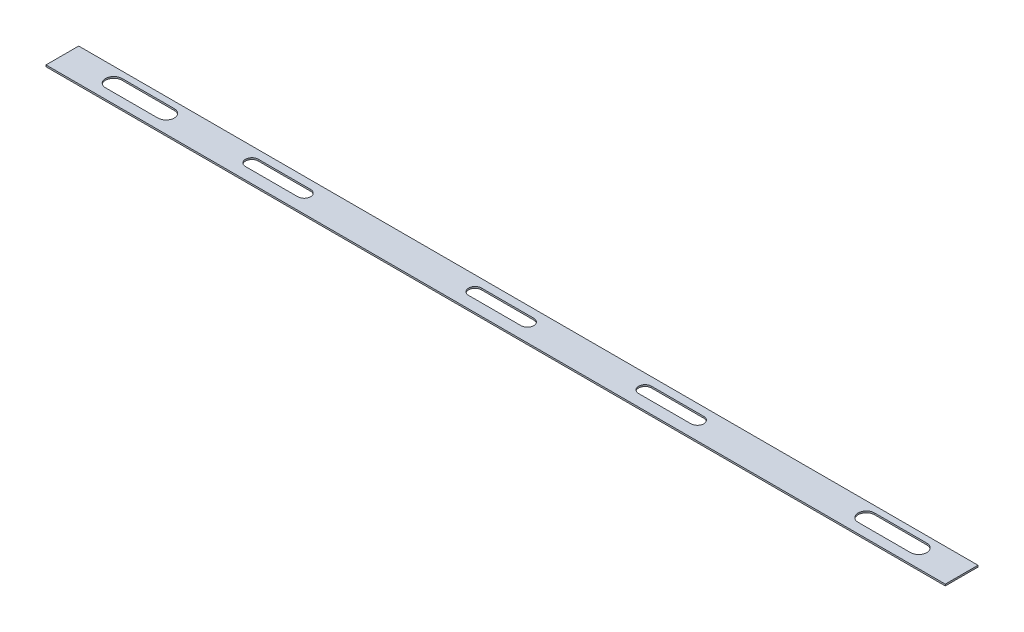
ISO-10303-21;
HEADER;
FILE_DESCRIPTION(('STEP AP214'),'2;1');
FILE_NAME('part.step','',(''),(''),'','','');
FILE_SCHEMA(('AUTOMOTIVE_DESIGN { 1 0 10303 214 1 1 1 1 }'));
ENDSEC;
DATA;
#1=APPLICATION_CONTEXT('core data for automotive mechanical design processes');
#2=APPLICATION_PROTOCOL_DEFINITION('international standard','automotive_design',2000,#1);
#3=PRODUCT_CONTEXT('',#1,'mechanical');
#4=PRODUCT('Part','Part','',(#3));
#5=PRODUCT_RELATED_PRODUCT_CATEGORY('part','',(#4));
#6=PRODUCT_DEFINITION_FORMATION('','',#4);
#7=PRODUCT_DEFINITION_CONTEXT('part definition',#1,'design');
#8=PRODUCT_DEFINITION('design','',#6,#7);
#9=PRODUCT_DEFINITION_SHAPE('','',#8);
#10=(LENGTH_UNIT() NAMED_UNIT(*) SI_UNIT(.MILLI.,.METRE.));
#11=(NAMED_UNIT(*) PLANE_ANGLE_UNIT() SI_UNIT($,.RADIAN.));
#12=(NAMED_UNIT(*) SI_UNIT($,.STERADIAN.) SOLID_ANGLE_UNIT());
#13=UNCERTAINTY_MEASURE_WITH_UNIT(LENGTH_MEASURE(1.E-05),#10,'distance_accuracy_value','');
#14=(GEOMETRIC_REPRESENTATION_CONTEXT(3) GLOBAL_UNCERTAINTY_ASSIGNED_CONTEXT((#13)) GLOBAL_UNIT_ASSIGNED_CONTEXT((#10,
#11,#12)) REPRESENTATION_CONTEXT('',''));
#15=CARTESIAN_POINT('',(0.,0.,0.));
#16=DIRECTION('',(0.,0.,1.));
#17=DIRECTION('',(1.,0.,0.));
#18=AXIS2_PLACEMENT_3D('',#15,#16,#17);
#19=CARTESIAN_POINT('',(0.,0.635,0.));
#20=DIRECTION('',(1.,0.,0.));
#21=DIRECTION('',(0.,0.,-1.));
#22=AXIS2_PLACEMENT_3D('',#19,#20,#21);
#23=PLANE('',#22);
#24=DIRECTION('',(0.,0.,1.));
#25=VECTOR('',#24,1.);
#26=CARTESIAN_POINT('',(0.,0.,0.));
#27=LINE('',#26,#25);
#28=CARTESIAN_POINT('',(0.,0.,-12.7));
#29=VERTEX_POINT('',#28);
#30=CARTESIAN_POINT('',(0.,0.,0.));
#31=VERTEX_POINT('',#30);
#32=EDGE_CURVE('E247',#29,#31,#27,.T.);
#33=ORIENTED_EDGE('',*,*,#32,.T.);
#34=DIRECTION('',(0.,-1.,0.));
#35=VECTOR('',#34,1.);
#36=CARTESIAN_POINT('',(0.,0.635,0.));
#37=LINE('',#36,#35);
#38=CARTESIAN_POINT('',(0.,0.635,0.));
#39=VERTEX_POINT('',#38);
#40=EDGE_CURVE('E11',#39,#31,#37,.T.);
#41=ORIENTED_EDGE('',*,*,#40,.F.);
#42=DIRECTION('',(0.,0.,1.));
#43=VECTOR('',#42,1.);
#44=CARTESIAN_POINT('',(0.,0.635,0.));
#45=LINE('',#44,#43);
#46=CARTESIAN_POINT('',(0.,0.635,-12.7));
#47=VERTEX_POINT('',#46);
#48=EDGE_CURVE('E426',#47,#39,#45,.T.);
#49=ORIENTED_EDGE('',*,*,#48,.F.);
#50=DIRECTION('',(0.,-1.,0.));
#51=VECTOR('',#50,1.);
#52=CARTESIAN_POINT('',(0.,0.635,-12.7));
#53=LINE('',#52,#51);
#54=EDGE_CURVE('E440',#47,#29,#53,.T.);
#55=ORIENTED_EDGE('',*,*,#54,.T.);
#56=EDGE_LOOP('',(#33,#41,#49,#55));
#57=FACE_BOUND('',#56,.T.);
#58=ADVANCED_FACE('F39',(#57),#23,.F.);
#59=CARTESIAN_POINT('',(0.,0.635,0.));
#60=DIRECTION('',(0.,0.,-1.));
#61=DIRECTION('',(-1.,0.,0.));
#62=AXIS2_PLACEMENT_3D('',#59,#60,#61);
#63=PLANE('',#62);
#64=DIRECTION('',(1.,0.,0.));
#65=VECTOR('',#64,1.);
#66=CARTESIAN_POINT('',(0.,0.,0.));
#67=LINE('',#66,#65);
#68=CARTESIAN_POINT('',(349.25,0.,0.));
#69=VERTEX_POINT('',#68);
#70=EDGE_CURVE('E444',#31,#69,#67,.T.);
#71=ORIENTED_EDGE('',*,*,#70,.T.);
#72=DIRECTION('',(0.,-1.,0.));
#73=VECTOR('',#72,1.);
#74=CARTESIAN_POINT('',(349.25,0.635,0.));
#75=LINE('',#74,#73);
#76=CARTESIAN_POINT('',(349.25,0.635,0.));
#77=VERTEX_POINT('',#76);
#78=EDGE_CURVE('E47',#77,#69,#75,.T.);
#79=ORIENTED_EDGE('',*,*,#78,.F.);
#80=DIRECTION('',(1.,0.,0.));
#81=VECTOR('',#80,1.);
#82=CARTESIAN_POINT('',(0.,0.635,0.));
#83=LINE('',#82,#81);
#84=EDGE_CURVE('E430',#39,#77,#83,.T.);
#85=ORIENTED_EDGE('',*,*,#84,.F.);
#86=ORIENTED_EDGE('',*,*,#40,.T.);
#87=EDGE_LOOP('',(#71,#79,#85,#86));
#88=FACE_BOUND('',#87,.T.);
#89=ADVANCED_FACE('F479',(#88),#63,.F.);
#90=CARTESIAN_POINT('',(349.25,0.635,0.));
#91=DIRECTION('',(-1.,0.,0.));
#92=DIRECTION('',(0.,0.,1.));
#93=AXIS2_PLACEMENT_3D('',#90,#91,#92);
#94=PLANE('',#93);
#95=DIRECTION('',(0.,0.,-1.));
#96=VECTOR('',#95,1.);
#97=CARTESIAN_POINT('',(349.25,0.,0.));
#98=LINE('',#97,#96);
#99=CARTESIAN_POINT('',(349.25,0.,-12.7));
#100=VERTEX_POINT('',#99);
#101=EDGE_CURVE('E447',#69,#100,#98,.T.);
#102=ORIENTED_EDGE('',*,*,#101,.T.);
#103=DIRECTION('',(0.,-1.,0.));
#104=VECTOR('',#103,1.);
#105=CARTESIAN_POINT('',(349.25,0.635,-12.7));
#106=LINE('',#105,#104);
#107=CARTESIAN_POINT('',(349.25,0.635,-12.7));
#108=VERTEX_POINT('',#107);
#109=EDGE_CURVE('E455',#108,#100,#106,.T.);
#110=ORIENTED_EDGE('',*,*,#109,.F.);
#111=DIRECTION('',(0.,0.,-1.));
#112=VECTOR('',#111,1.);
#113=CARTESIAN_POINT('',(349.25,0.635,0.));
#114=LINE('',#113,#112);
#115=EDGE_CURVE('E434',#77,#108,#114,.T.);
#116=ORIENTED_EDGE('',*,*,#115,.F.);
#117=ORIENTED_EDGE('',*,*,#78,.T.);
#118=EDGE_LOOP('',(#102,#110,#116,#117));
#119=FACE_BOUND('',#118,.T.);
#120=ADVANCED_FACE('F464',(#119),#94,.F.);
#121=CARTESIAN_POINT('',(0.,0.635,-12.7));
#122=DIRECTION('',(0.,0.,1.));
#123=DIRECTION('',(1.,0.,0.));
#124=AXIS2_PLACEMENT_3D('',#121,#122,#123);
#125=PLANE('',#124);
#126=DIRECTION('',(-1.,0.,0.));
#127=VECTOR('',#126,1.);
#128=CARTESIAN_POINT('',(0.,0.,-12.7));
#129=LINE('',#128,#127);
#130=EDGE_CURVE('E431',#100,#29,#129,.T.);
#131=ORIENTED_EDGE('',*,*,#130,.T.);
#132=ORIENTED_EDGE('',*,*,#54,.F.);
#133=DIRECTION('',(-1.,0.,0.));
#134=VECTOR('',#133,1.);
#135=CARTESIAN_POINT('',(0.,0.635,-12.7));
#136=LINE('',#135,#134);
#137=EDGE_CURVE('E437',#108,#47,#136,.T.);
#138=ORIENTED_EDGE('',*,*,#137,.F.);
#139=ORIENTED_EDGE('',*,*,#109,.T.);
#140=EDGE_LOOP('',(#131,#132,#138,#139));
#141=FACE_BOUND('',#140,.T.);
#142=ADVANCED_FACE('F472',(#141),#125,.F.);
#143=CARTESIAN_POINT('',(0.,0.635,-12.7));
#144=DIRECTION('',(0.,-1.,0.));
#145=DIRECTION('',(0.,0.,-1.));
#146=AXIS2_PLACEMENT_3D('',#143,#144,#145);
#147=PLANE('',#146);
#148=DIRECTION('',(1.,0.,0.));
#149=VECTOR('',#148,1.);
#150=CARTESIAN_POINT('',(19.2867365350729,0.635,-3.85460009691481));
#151=LINE('',#150,#149);
#152=CARTESIAN_POINT('',(19.2867365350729,0.635,-3.85460009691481));
#153=VERTEX_POINT('',#152);
#154=CARTESIAN_POINT('',(39.6067365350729,0.635,-3.85460009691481));
#155=VERTEX_POINT('',#154);
#156=EDGE_CURVE('E237',#153,#155,#151,.T.);
#157=ORIENTED_EDGE('',*,*,#156,.F.);
#158=CARTESIAN_POINT('',(19.2867365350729,0.635,-7.02960009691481));
#159=DIRECTION('',(0.,1.,0.));
#160=DIRECTION('',(0.,0.,1.));
#161=AXIS2_PLACEMENT_3D('',#158,#159,#160);
#162=CIRCLE('',#161,3.175);
#163=CARTESIAN_POINT('',(19.2867365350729,0.635,-10.2046000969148));
#164=VERTEX_POINT('',#163);
#165=EDGE_CURVE('E54',#164,#153,#162,.T.);
#166=ORIENTED_EDGE('',*,*,#165,.F.);
#167=DIRECTION('',(-1.,0.,0.));
#168=VECTOR('',#167,1.);
#169=CARTESIAN_POINT('',(19.2867365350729,0.635,-10.2046000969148));
#170=LINE('',#169,#168);
#171=CARTESIAN_POINT('',(39.6067365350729,0.635,-10.2046000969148));
#172=VERTEX_POINT('',#171);
#173=EDGE_CURVE('E224',#172,#164,#170,.T.);
#174=ORIENTED_EDGE('',*,*,#173,.F.);
#175=CARTESIAN_POINT('',(39.6067365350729,0.635,-7.02960009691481));
#176=DIRECTION('',(0.,1.,0.));
#177=DIRECTION('',(0.,0.,1.));
#178=AXIS2_PLACEMENT_3D('',#175,#176,#177);
#179=CIRCLE('',#178,3.175);
#180=EDGE_CURVE('E228',#155,#172,#179,.T.);
#181=ORIENTED_EDGE('',*,*,#180,.F.);
#182=EDGE_LOOP('',(#157,#166,#174,#181));
#183=FACE_BOUND('',#182,.T.);
#184=DIRECTION('',(1.,0.,0.));
#185=VECTOR('',#184,1.);
#186=CARTESIAN_POINT('',(72.9346796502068,0.635,-4.55310009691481));
#187=LINE('',#186,#185);
#188=CARTESIAN_POINT('',(72.9346796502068,0.635,-4.55310009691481));
#189=VERTEX_POINT('',#188);
#190=CARTESIAN_POINT('',(93.2546796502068,0.635,-4.55310009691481));
#191=VERTEX_POINT('',#190);
#192=EDGE_CURVE('E273',#189,#191,#187,.T.);
#193=ORIENTED_EDGE('',*,*,#192,.F.);
#194=CARTESIAN_POINT('',(72.9346796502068,0.635,-7.02960009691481));
#195=DIRECTION('',(0.,1.,0.));
#196=DIRECTION('',(0.,0.,1.));
#197=AXIS2_PLACEMENT_3D('',#194,#195,#196);
#198=CIRCLE('',#197,2.4765);
#199=CARTESIAN_POINT('',(72.9346796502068,0.635,-9.50610009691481));
#200=VERTEX_POINT('',#199);
#201=EDGE_CURVE('E62',#200,#189,#198,.T.);
#202=ORIENTED_EDGE('',*,*,#201,.F.);
#203=DIRECTION('',(-1.,0.,0.));
#204=VECTOR('',#203,1.);
#205=CARTESIAN_POINT('',(72.9346796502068,0.635,-9.50610009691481));
#206=LINE('',#205,#204);
#207=CARTESIAN_POINT('',(93.2546796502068,0.635,-9.50610009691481));
#208=VERTEX_POINT('',#207);
#209=EDGE_CURVE('E258',#208,#200,#206,.T.);
#210=ORIENTED_EDGE('',*,*,#209,.F.);
#211=CARTESIAN_POINT('',(93.2546796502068,0.635,-7.02960009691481));
#212=DIRECTION('',(0.,1.,0.));
#213=DIRECTION('',(0.,0.,1.));
#214=AXIS2_PLACEMENT_3D('',#211,#212,#213);
#215=CIRCLE('',#214,2.4765);
#216=EDGE_CURVE('E278',#191,#208,#215,.T.);
#217=ORIENTED_EDGE('',*,*,#216,.F.);
#218=EDGE_LOOP('',(#193,#202,#210,#217));
#219=FACE_BOUND('',#218,.T.);
#220=DIRECTION('',(1.,0.,0.));
#221=VECTOR('',#220,1.);
#222=CARTESIAN_POINT('',(159.602261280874,0.635,-4.54040009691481));
#223=LINE('',#222,#221);
#224=CARTESIAN_POINT('',(159.602261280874,0.635,-4.54040009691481));
#225=VERTEX_POINT('',#224);
#226=CARTESIAN_POINT('',(179.922261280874,0.635,-4.54040009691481));
#227=VERTEX_POINT('',#226);
#228=EDGE_CURVE('E316',#225,#227,#223,.T.);
#229=ORIENTED_EDGE('',*,*,#228,.F.);
#230=CARTESIAN_POINT('',(159.602261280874,0.635,-7.02960009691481));
#231=DIRECTION('',(0.,1.,0.));
#232=DIRECTION('',(0.,0.,1.));
#233=AXIS2_PLACEMENT_3D('',#230,#231,#232);
#234=CIRCLE('',#233,2.4892);
#235=CARTESIAN_POINT('',(159.602261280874,0.635,-9.51880009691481));
#236=VERTEX_POINT('',#235);
#237=EDGE_CURVE('E313',#236,#225,#234,.T.);
#238=ORIENTED_EDGE('',*,*,#237,.F.);
#239=DIRECTION('',(-1.,0.,0.));
#240=VECTOR('',#239,1.);
#241=CARTESIAN_POINT('',(159.602261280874,0.635,-9.51880009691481));
#242=LINE('',#241,#240);
#243=CARTESIAN_POINT('',(179.922261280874,0.635,-9.51880009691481));
#244=VERTEX_POINT('',#243);
#245=EDGE_CURVE('E300',#244,#236,#242,.T.);
#246=ORIENTED_EDGE('',*,*,#245,.F.);
#247=CARTESIAN_POINT('',(179.922261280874,0.635,-7.02960009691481));
#248=DIRECTION('',(0.,1.,0.));
#249=DIRECTION('',(0.,0.,1.));
#250=AXIS2_PLACEMENT_3D('',#247,#248,#249);
#251=CIRCLE('',#250,2.4892);
#252=EDGE_CURVE('E321',#227,#244,#251,.T.);
#253=ORIENTED_EDGE('',*,*,#252,.F.);
#254=EDGE_LOOP('',(#229,#238,#246,#253));
#255=FACE_BOUND('',#254,.T.);
#256=DIRECTION('',(1.,0.,0.));
#257=VECTOR('',#256,1.);
#258=CARTESIAN_POINT('',(225.616547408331,0.635,-4.54040009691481));
#259=LINE('',#258,#257);
#260=CARTESIAN_POINT('',(225.616547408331,0.635,-4.54040009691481));
#261=VERTEX_POINT('',#260);
#262=CARTESIAN_POINT('',(245.936547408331,0.635,-4.54040009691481));
#263=VERTEX_POINT('',#262);
#264=EDGE_CURVE('E360',#261,#263,#259,.T.);
#265=ORIENTED_EDGE('',*,*,#264,.F.);
#266=CARTESIAN_POINT('',(225.616547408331,0.635,-7.02960009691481));
#267=DIRECTION('',(0.,1.,0.));
#268=DIRECTION('',(0.,0.,1.));
#269=AXIS2_PLACEMENT_3D('',#266,#267,#268);
#270=CIRCLE('',#269,2.4892);
#271=CARTESIAN_POINT('',(225.616547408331,0.635,-9.51880009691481));
#272=VERTEX_POINT('',#271);
#273=EDGE_CURVE('E357',#272,#261,#270,.T.);
#274=ORIENTED_EDGE('',*,*,#273,.F.);
#275=DIRECTION('',(-1.,0.,0.));
#276=VECTOR('',#275,1.);
#277=CARTESIAN_POINT('',(225.616547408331,0.635,-9.51880009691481));
#278=LINE('',#277,#276);
#279=CARTESIAN_POINT('',(245.936547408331,0.635,-9.51880009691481));
#280=VERTEX_POINT('',#279);
#281=EDGE_CURVE('E344',#280,#272,#278,.T.);
#282=ORIENTED_EDGE('',*,*,#281,.F.);
#283=CARTESIAN_POINT('',(245.936547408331,0.635,-7.02960009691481));
#284=DIRECTION('',(0.,1.,0.));
#285=DIRECTION('',(0.,0.,1.));
#286=AXIS2_PLACEMENT_3D('',#283,#284,#285);
#287=CIRCLE('',#286,2.4892);
#288=EDGE_CURVE('E365',#263,#280,#287,.T.);
#289=ORIENTED_EDGE('',*,*,#288,.F.);
#290=EDGE_LOOP('',(#265,#274,#282,#289));
#291=FACE_BOUND('',#290,.T.);
#292=DIRECTION('',(1.,0.,0.));
#293=VECTOR('',#292,1.);
#294=CARTESIAN_POINT('',(311.55967463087,0.635,-3.85460009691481));
#295=LINE('',#294,#293);
#296=CARTESIAN_POINT('',(311.55967463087,0.635,-3.85460009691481));
#297=VERTEX_POINT('',#296);
#298=CARTESIAN_POINT('',(331.87967463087,0.635,-3.85460009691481));
#299=VERTEX_POINT('',#298);
#300=EDGE_CURVE('E404',#297,#299,#295,.T.);
#301=ORIENTED_EDGE('',*,*,#300,.F.);
#302=CARTESIAN_POINT('',(311.55967463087,0.635,-7.02960009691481));
#303=DIRECTION('',(0.,1.,0.));
#304=DIRECTION('',(0.,0.,1.));
#305=AXIS2_PLACEMENT_3D('',#302,#303,#304);
#306=CIRCLE('',#305,3.175);
#307=CARTESIAN_POINT('',(311.55967463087,0.635,-10.2046000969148));
#308=VERTEX_POINT('',#307);
#309=EDGE_CURVE('E401',#308,#297,#306,.T.);
#310=ORIENTED_EDGE('',*,*,#309,.F.);
#311=DIRECTION('',(-1.,0.,0.));
#312=VECTOR('',#311,1.);
#313=CARTESIAN_POINT('',(311.55967463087,0.635,-10.2046000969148));
#314=LINE('',#313,#312);
#315=CARTESIAN_POINT('',(331.87967463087,0.635,-10.2046000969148));
#316=VERTEX_POINT('',#315);
#317=EDGE_CURVE('E388',#316,#308,#314,.T.);
#318=ORIENTED_EDGE('',*,*,#317,.F.);
#319=CARTESIAN_POINT('',(331.87967463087,0.635,-7.02960009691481));
#320=DIRECTION('',(0.,1.,0.));
#321=DIRECTION('',(0.,0.,1.));
#322=AXIS2_PLACEMENT_3D('',#319,#320,#321);
#323=CIRCLE('',#322,3.175);
#324=EDGE_CURVE('E408',#299,#316,#323,.T.);
#325=ORIENTED_EDGE('',*,*,#324,.F.);
#326=EDGE_LOOP('',(#301,#310,#318,#325));
#327=FACE_BOUND('',#326,.T.);
#328=ORIENTED_EDGE('',*,*,#48,.T.);
#329=ORIENTED_EDGE('',*,*,#84,.T.);
#330=ORIENTED_EDGE('',*,*,#115,.T.);
#331=ORIENTED_EDGE('',*,*,#137,.T.);
#332=EDGE_LOOP('',(#328,#329,#330,#331));
#333=FACE_BOUND('',#332,.T.);
#334=ADVANCED_FACE('F478',(#183,#219,#255,#291,#327,#333),#147,.F.);
#335=CARTESIAN_POINT('',(0.,0.,-12.7));
#336=DIRECTION('',(0.,-1.,0.));
#337=DIRECTION('',(0.,0.,-1.));
#338=AXIS2_PLACEMENT_3D('',#335,#336,#337);
#339=PLANE('',#338);
#340=CARTESIAN_POINT('',(19.2867365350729,0.,-7.02960009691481));
#341=DIRECTION('',(0.,1.,0.));
#342=DIRECTION('',(0.,0.,1.));
#343=AXIS2_PLACEMENT_3D('',#340,#341,#342);
#344=CIRCLE('',#343,3.175);
#345=CARTESIAN_POINT('',(19.2867365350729,0.,-10.2046000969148));
#346=VERTEX_POINT('',#345);
#347=CARTESIAN_POINT('',(19.2867365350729,0.,-3.85460009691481));
#348=VERTEX_POINT('',#347);
#349=EDGE_CURVE('E202',#346,#348,#344,.T.);
#350=ORIENTED_EDGE('',*,*,#349,.T.);
#351=DIRECTION('',(1.,0.,0.));
#352=VECTOR('',#351,1.);
#353=CARTESIAN_POINT('',(19.2867365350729,0.,-3.85460009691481));
#354=LINE('',#353,#352);
#355=CARTESIAN_POINT('',(39.6067365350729,0.,-3.85460009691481));
#356=VERTEX_POINT('',#355);
#357=EDGE_CURVE('E213',#348,#356,#354,.T.);
#358=ORIENTED_EDGE('',*,*,#357,.T.);
#359=CARTESIAN_POINT('',(39.6067365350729,0.,-7.02960009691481));
#360=DIRECTION('',(0.,1.,0.));
#361=DIRECTION('',(0.,0.,1.));
#362=AXIS2_PLACEMENT_3D('',#359,#360,#361);
#363=CIRCLE('',#362,3.175);
#364=CARTESIAN_POINT('',(39.6067365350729,0.,-10.2046000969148));
#365=VERTEX_POINT('',#364);
#366=EDGE_CURVE('E218',#356,#365,#363,.T.);
#367=ORIENTED_EDGE('',*,*,#366,.T.);
#368=DIRECTION('',(-1.,0.,0.));
#369=VECTOR('',#368,1.);
#370=CARTESIAN_POINT('',(19.2867365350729,0.,-10.2046000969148));
#371=LINE('',#370,#369);
#372=EDGE_CURVE('E209',#365,#346,#371,.T.);
#373=ORIENTED_EDGE('',*,*,#372,.T.);
#374=EDGE_LOOP('',(#350,#358,#367,#373));
#375=FACE_BOUND('',#374,.T.);
#376=CARTESIAN_POINT('',(72.9346796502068,0.,-7.02960009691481));
#377=DIRECTION('',(0.,1.,0.));
#378=DIRECTION('',(0.,0.,1.));
#379=AXIS2_PLACEMENT_3D('',#376,#377,#378);
#380=CIRCLE('',#379,2.4765);
#381=CARTESIAN_POINT('',(72.9346796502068,0.,-9.50610009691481));
#382=VERTEX_POINT('',#381);
#383=CARTESIAN_POINT('',(72.9346796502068,0.,-4.55310009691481));
#384=VERTEX_POINT('',#383);
#385=EDGE_CURVE('E253',#382,#384,#380,.T.);
#386=ORIENTED_EDGE('',*,*,#385,.T.);
#387=DIRECTION('',(1.,0.,0.));
#388=VECTOR('',#387,1.);
#389=CARTESIAN_POINT('',(72.9346796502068,0.,-4.55310009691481));
#390=LINE('',#389,#388);
#391=CARTESIAN_POINT('',(93.2546796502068,0.,-4.55310009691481));
#392=VERTEX_POINT('',#391);
#393=EDGE_CURVE('E257',#384,#392,#390,.T.);
#394=ORIENTED_EDGE('',*,*,#393,.T.);
#395=CARTESIAN_POINT('',(93.2546796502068,0.,-7.02960009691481));
#396=DIRECTION('',(0.,1.,0.));
#397=DIRECTION('',(0.,0.,1.));
#398=AXIS2_PLACEMENT_3D('',#395,#396,#397);
#399=CIRCLE('',#398,2.4765);
#400=CARTESIAN_POINT('',(93.2546796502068,0.,-9.50610009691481));
#401=VERTEX_POINT('',#400);
#402=EDGE_CURVE('E262',#392,#401,#399,.T.);
#403=ORIENTED_EDGE('',*,*,#402,.T.);
#404=DIRECTION('',(-1.,0.,0.));
#405=VECTOR('',#404,1.);
#406=CARTESIAN_POINT('',(72.9346796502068,0.,-9.50610009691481));
#407=LINE('',#406,#405);
#408=EDGE_CURVE('E266',#401,#382,#407,.T.);
#409=ORIENTED_EDGE('',*,*,#408,.T.);
#410=EDGE_LOOP('',(#386,#394,#403,#409));
#411=FACE_BOUND('',#410,.T.);
#412=CARTESIAN_POINT('',(159.602261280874,0.,-7.02960009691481));
#413=DIRECTION('',(0.,1.,0.));
#414=DIRECTION('',(0.,0.,1.));
#415=AXIS2_PLACEMENT_3D('',#412,#413,#414);
#416=CIRCLE('',#415,2.4892);
#417=CARTESIAN_POINT('',(159.602261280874,0.,-9.51880009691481));
#418=VERTEX_POINT('',#417);
#419=CARTESIAN_POINT('',(159.602261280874,0.,-4.54040009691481));
#420=VERTEX_POINT('',#419);
#421=EDGE_CURVE('E295',#418,#420,#416,.T.);
#422=ORIENTED_EDGE('',*,*,#421,.T.);
#423=DIRECTION('',(1.,0.,0.));
#424=VECTOR('',#423,1.);
#425=CARTESIAN_POINT('',(159.602261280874,0.,-4.54040009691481));
#426=LINE('',#425,#424);
#427=CARTESIAN_POINT('',(179.922261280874,0.,-4.54040009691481));
#428=VERTEX_POINT('',#427);
#429=EDGE_CURVE('E299',#420,#428,#426,.T.);
#430=ORIENTED_EDGE('',*,*,#429,.T.);
#431=CARTESIAN_POINT('',(179.922261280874,0.,-7.02960009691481));
#432=DIRECTION('',(0.,1.,0.));
#433=DIRECTION('',(0.,0.,1.));
#434=AXIS2_PLACEMENT_3D('',#431,#432,#433);
#435=CIRCLE('',#434,2.4892);
#436=CARTESIAN_POINT('',(179.922261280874,0.,-9.51880009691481));
#437=VERTEX_POINT('',#436);
#438=EDGE_CURVE('E304',#428,#437,#435,.T.);
#439=ORIENTED_EDGE('',*,*,#438,.T.);
#440=DIRECTION('',(-1.,0.,0.));
#441=VECTOR('',#440,1.);
#442=CARTESIAN_POINT('',(159.602261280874,0.,-9.51880009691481));
#443=LINE('',#442,#441);
#444=EDGE_CURVE('E308',#437,#418,#443,.T.);
#445=ORIENTED_EDGE('',*,*,#444,.T.);
#446=EDGE_LOOP('',(#422,#430,#439,#445));
#447=FACE_BOUND('',#446,.T.);
#448=CARTESIAN_POINT('',(225.616547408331,0.,-7.02960009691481));
#449=DIRECTION('',(0.,1.,0.));
#450=DIRECTION('',(0.,0.,1.));
#451=AXIS2_PLACEMENT_3D('',#448,#449,#450);
#452=CIRCLE('',#451,2.4892);
#453=CARTESIAN_POINT('',(225.616547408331,0.,-9.51880009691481));
#454=VERTEX_POINT('',#453);
#455=CARTESIAN_POINT('',(225.616547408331,0.,-4.54040009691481));
#456=VERTEX_POINT('',#455);
#457=EDGE_CURVE('E339',#454,#456,#452,.T.);
#458=ORIENTED_EDGE('',*,*,#457,.T.);
#459=DIRECTION('',(1.,0.,0.));
#460=VECTOR('',#459,1.);
#461=CARTESIAN_POINT('',(225.616547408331,0.,-4.54040009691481));
#462=LINE('',#461,#460);
#463=CARTESIAN_POINT('',(245.936547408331,0.,-4.54040009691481));
#464=VERTEX_POINT('',#463);
#465=EDGE_CURVE('E343',#456,#464,#462,.T.);
#466=ORIENTED_EDGE('',*,*,#465,.T.);
#467=CARTESIAN_POINT('',(245.936547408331,0.,-7.02960009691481));
#468=DIRECTION('',(0.,1.,0.));
#469=DIRECTION('',(0.,0.,1.));
#470=AXIS2_PLACEMENT_3D('',#467,#468,#469);
#471=CIRCLE('',#470,2.4892);
#472=CARTESIAN_POINT('',(245.936547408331,0.,-9.51880009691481));
#473=VERTEX_POINT('',#472);
#474=EDGE_CURVE('E348',#464,#473,#471,.T.);
#475=ORIENTED_EDGE('',*,*,#474,.T.);
#476=DIRECTION('',(-1.,0.,0.));
#477=VECTOR('',#476,1.);
#478=CARTESIAN_POINT('',(225.616547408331,0.,-9.51880009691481));
#479=LINE('',#478,#477);
#480=EDGE_CURVE('E352',#473,#454,#479,.T.);
#481=ORIENTED_EDGE('',*,*,#480,.T.);
#482=EDGE_LOOP('',(#458,#466,#475,#481));
#483=FACE_BOUND('',#482,.T.);
#484=CARTESIAN_POINT('',(311.55967463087,0.,-7.02960009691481));
#485=DIRECTION('',(0.,1.,0.));
#486=DIRECTION('',(0.,0.,1.));
#487=AXIS2_PLACEMENT_3D('',#484,#485,#486);
#488=CIRCLE('',#487,3.175);
#489=CARTESIAN_POINT('',(311.55967463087,0.,-10.2046000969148));
#490=VERTEX_POINT('',#489);
#491=CARTESIAN_POINT('',(311.55967463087,0.,-3.85460009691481));
#492=VERTEX_POINT('',#491);
#493=EDGE_CURVE('E383',#490,#492,#488,.T.);
#494=ORIENTED_EDGE('',*,*,#493,.T.);
#495=DIRECTION('',(1.,0.,0.));
#496=VECTOR('',#495,1.);
#497=CARTESIAN_POINT('',(311.55967463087,0.,-3.85460009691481));
#498=LINE('',#497,#496);
#499=CARTESIAN_POINT('',(331.87967463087,0.,-3.85460009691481));
#500=VERTEX_POINT('',#499);
#501=EDGE_CURVE('E387',#492,#500,#498,.T.);
#502=ORIENTED_EDGE('',*,*,#501,.T.);
#503=CARTESIAN_POINT('',(331.87967463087,0.,-7.02960009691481));
#504=DIRECTION('',(0.,1.,0.));
#505=DIRECTION('',(0.,0.,1.));
#506=AXIS2_PLACEMENT_3D('',#503,#504,#505);
#507=CIRCLE('',#506,3.175);
#508=CARTESIAN_POINT('',(331.87967463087,0.,-10.2046000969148));
#509=VERTEX_POINT('',#508);
#510=EDGE_CURVE('E392',#500,#509,#507,.T.);
#511=ORIENTED_EDGE('',*,*,#510,.T.);
#512=DIRECTION('',(-1.,0.,0.));
#513=VECTOR('',#512,1.);
#514=CARTESIAN_POINT('',(311.55967463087,0.,-10.2046000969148));
#515=LINE('',#514,#513);
#516=EDGE_CURVE('E396',#509,#490,#515,.T.);
#517=ORIENTED_EDGE('',*,*,#516,.T.);
#518=EDGE_LOOP('',(#494,#502,#511,#517));
#519=FACE_BOUND('',#518,.T.);
#520=ORIENTED_EDGE('',*,*,#32,.F.);
#521=ORIENTED_EDGE('',*,*,#130,.F.);
#522=ORIENTED_EDGE('',*,*,#101,.F.);
#523=ORIENTED_EDGE('',*,*,#70,.F.);
#524=EDGE_LOOP('',(#520,#521,#522,#523));
#525=FACE_BOUND('',#524,.T.);
#526=ADVANCED_FACE('F220',(#375,#411,#447,#483,#519,#525),#339,.T.);
#527=CARTESIAN_POINT('',(311.55967463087,0.,-7.02960009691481));
#528=DIRECTION('',(0.,1.,0.));
#529=DIRECTION('',(0.,0.,1.));
#530=AXIS2_PLACEMENT_3D('',#527,#528,#529);
#531=CYLINDRICAL_SURFACE('',#530,3.175);
#532=ORIENTED_EDGE('',*,*,#309,.T.);
#533=DIRECTION('',(0.,1.,0.));
#534=VECTOR('',#533,1.);
#535=CARTESIAN_POINT('',(311.55967463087,0.,-3.85460009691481));
#536=LINE('',#535,#534);
#537=EDGE_CURVE('E400',#492,#297,#536,.T.);
#538=ORIENTED_EDGE('',*,*,#537,.F.);
#539=ORIENTED_EDGE('',*,*,#493,.F.);
#540=DIRECTION('',(0.,1.,0.));
#541=VECTOR('',#540,1.);
#542=CARTESIAN_POINT('',(311.55967463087,0.,-10.2046000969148));
#543=LINE('',#542,#541);
#544=EDGE_CURVE('E361',#490,#308,#543,.T.);
#545=ORIENTED_EDGE('',*,*,#544,.T.);
#546=EDGE_LOOP('',(#532,#538,#539,#545));
#547=FACE_BOUND('',#546,.T.);
#548=ADVANCED_FACE('F491',(#547),#531,.F.);
#549=CARTESIAN_POINT('',(311.55967463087,0.,-10.2046000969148));
#550=DIRECTION('',(0.,0.,-1.));
#551=DIRECTION('',(-1.,0.,0.));
#552=AXIS2_PLACEMENT_3D('',#549,#550,#551);
#553=PLANE('',#552);
#554=ORIENTED_EDGE('',*,*,#317,.T.);
#555=ORIENTED_EDGE('',*,*,#544,.F.);
#556=ORIENTED_EDGE('',*,*,#516,.F.);
#557=DIRECTION('',(0.,1.,0.));
#558=VECTOR('',#557,1.);
#559=CARTESIAN_POINT('',(331.87967463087,0.,-10.2046000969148));
#560=LINE('',#559,#558);
#561=EDGE_CURVE('E417',#509,#316,#560,.T.);
#562=ORIENTED_EDGE('',*,*,#561,.T.);
#563=EDGE_LOOP('',(#554,#555,#556,#562));
#564=FACE_BOUND('',#563,.T.);
#565=ADVANCED_FACE('F497',(#564),#553,.F.);
#566=CARTESIAN_POINT('',(331.87967463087,0.,-7.02960009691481));
#567=DIRECTION('',(0.,1.,0.));
#568=DIRECTION('',(0.,0.,1.));
#569=AXIS2_PLACEMENT_3D('',#566,#567,#568);
#570=CYLINDRICAL_SURFACE('',#569,3.175);
#571=ORIENTED_EDGE('',*,*,#324,.T.);
#572=ORIENTED_EDGE('',*,*,#561,.F.);
#573=ORIENTED_EDGE('',*,*,#510,.F.);
#574=DIRECTION('',(0.,1.,0.));
#575=VECTOR('',#574,1.);
#576=CARTESIAN_POINT('',(331.87967463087,0.,-3.85460009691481));
#577=LINE('',#576,#575);
#578=EDGE_CURVE('E420',#500,#299,#577,.T.);
#579=ORIENTED_EDGE('',*,*,#578,.T.);
#580=EDGE_LOOP('',(#571,#572,#573,#579));
#581=FACE_BOUND('',#580,.T.);
#582=ADVANCED_FACE('F503',(#581),#570,.F.);
#583=CARTESIAN_POINT('',(311.55967463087,0.,-3.85460009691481));
#584=DIRECTION('',(0.,0.,1.));
#585=DIRECTION('',(1.,0.,0.));
#586=AXIS2_PLACEMENT_3D('',#583,#584,#585);
#587=PLANE('',#586);
#588=ORIENTED_EDGE('',*,*,#300,.T.);
#589=ORIENTED_EDGE('',*,*,#578,.F.);
#590=ORIENTED_EDGE('',*,*,#501,.F.);
#591=ORIENTED_EDGE('',*,*,#537,.T.);
#592=EDGE_LOOP('',(#588,#589,#590,#591));
#593=FACE_BOUND('',#592,.T.);
#594=ADVANCED_FACE('F499',(#593),#587,.F.);
#595=CARTESIAN_POINT('',(225.616547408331,0.,-7.02960009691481));
#596=DIRECTION('',(0.,1.,0.));
#597=DIRECTION('',(0.,0.,1.));
#598=AXIS2_PLACEMENT_3D('',#595,#596,#597);
#599=CYLINDRICAL_SURFACE('',#598,2.4892);
#600=ORIENTED_EDGE('',*,*,#273,.T.);
#601=DIRECTION('',(0.,1.,0.));
#602=VECTOR('',#601,1.);
#603=CARTESIAN_POINT('',(225.616547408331,0.,-4.54040009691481));
#604=LINE('',#603,#602);
#605=EDGE_CURVE('E356',#456,#261,#604,.T.);
#606=ORIENTED_EDGE('',*,*,#605,.F.);
#607=ORIENTED_EDGE('',*,*,#457,.F.);
#608=DIRECTION('',(0.,1.,0.));
#609=VECTOR('',#608,1.);
#610=CARTESIAN_POINT('',(225.616547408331,0.,-9.51880009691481));
#611=LINE('',#610,#609);
#612=EDGE_CURVE('E317',#454,#272,#611,.T.);
#613=ORIENTED_EDGE('',*,*,#612,.T.);
#614=EDGE_LOOP('',(#600,#606,#607,#613));
#615=FACE_BOUND('',#614,.T.);
#616=ADVANCED_FACE('F502',(#615),#599,.F.);
#617=CARTESIAN_POINT('',(225.616547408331,0.,-9.51880009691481));
#618=DIRECTION('',(0.,0.,-1.));
#619=DIRECTION('',(-1.,0.,0.));
#620=AXIS2_PLACEMENT_3D('',#617,#618,#619);
#621=PLANE('',#620);
#622=ORIENTED_EDGE('',*,*,#281,.T.);
#623=ORIENTED_EDGE('',*,*,#612,.F.);
#624=ORIENTED_EDGE('',*,*,#480,.F.);
#625=DIRECTION('',(0.,1.,0.));
#626=VECTOR('',#625,1.);
#627=CARTESIAN_POINT('',(245.936547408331,0.,-9.51880009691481));
#628=LINE('',#627,#626);
#629=EDGE_CURVE('E374',#473,#280,#628,.T.);
#630=ORIENTED_EDGE('',*,*,#629,.T.);
#631=EDGE_LOOP('',(#622,#623,#624,#630));
#632=FACE_BOUND('',#631,.T.);
#633=ADVANCED_FACE('F513',(#632),#621,.F.);
#634=CARTESIAN_POINT('',(245.936547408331,0.,-7.02960009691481));
#635=DIRECTION('',(0.,1.,0.));
#636=DIRECTION('',(0.,0.,1.));
#637=AXIS2_PLACEMENT_3D('',#634,#635,#636);
#638=CYLINDRICAL_SURFACE('',#637,2.4892);
#639=ORIENTED_EDGE('',*,*,#288,.T.);
#640=ORIENTED_EDGE('',*,*,#629,.F.);
#641=ORIENTED_EDGE('',*,*,#474,.F.);
#642=DIRECTION('',(0.,1.,0.));
#643=VECTOR('',#642,1.);
#644=CARTESIAN_POINT('',(245.936547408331,0.,-4.54040009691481));
#645=LINE('',#644,#643);
#646=EDGE_CURVE('E377',#464,#263,#645,.T.);
#647=ORIENTED_EDGE('',*,*,#646,.T.);
#648=EDGE_LOOP('',(#639,#640,#641,#647));
#649=FACE_BOUND('',#648,.T.);
#650=ADVANCED_FACE('F519',(#649),#638,.F.);
#651=CARTESIAN_POINT('',(225.616547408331,0.,-4.54040009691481));
#652=DIRECTION('',(0.,0.,1.));
#653=DIRECTION('',(1.,0.,0.));
#654=AXIS2_PLACEMENT_3D('',#651,#652,#653);
#655=PLANE('',#654);
#656=ORIENTED_EDGE('',*,*,#264,.T.);
#657=ORIENTED_EDGE('',*,*,#646,.F.);
#658=ORIENTED_EDGE('',*,*,#465,.F.);
#659=ORIENTED_EDGE('',*,*,#605,.T.);
#660=EDGE_LOOP('',(#656,#657,#658,#659));
#661=FACE_BOUND('',#660,.T.);
#662=ADVANCED_FACE('F515',(#661),#655,.F.);
#663=CARTESIAN_POINT('',(159.602261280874,0.,-7.02960009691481));
#664=DIRECTION('',(0.,1.,0.));
#665=DIRECTION('',(0.,0.,1.));
#666=AXIS2_PLACEMENT_3D('',#663,#664,#665);
#667=CYLINDRICAL_SURFACE('',#666,2.4892);
#668=ORIENTED_EDGE('',*,*,#237,.T.);
#669=DIRECTION('',(0.,1.,0.));
#670=VECTOR('',#669,1.);
#671=CARTESIAN_POINT('',(159.602261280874,0.,-4.54040009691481));
#672=LINE('',#671,#670);
#673=EDGE_CURVE('E312',#420,#225,#672,.T.);
#674=ORIENTED_EDGE('',*,*,#673,.F.);
#675=ORIENTED_EDGE('',*,*,#421,.F.);
#676=DIRECTION('',(0.,1.,0.));
#677=VECTOR('',#676,1.);
#678=CARTESIAN_POINT('',(159.602261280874,0.,-9.51880009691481));
#679=LINE('',#678,#677);
#680=EDGE_CURVE('E274',#418,#236,#679,.T.);
#681=ORIENTED_EDGE('',*,*,#680,.T.);
#682=EDGE_LOOP('',(#668,#674,#675,#681));
#683=FACE_BOUND('',#682,.T.);
#684=ADVANCED_FACE('F518',(#683),#667,.F.);
#685=CARTESIAN_POINT('',(159.602261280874,0.,-9.51880009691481));
#686=DIRECTION('',(0.,0.,-1.));
#687=DIRECTION('',(-1.,0.,0.));
#688=AXIS2_PLACEMENT_3D('',#685,#686,#687);
#689=PLANE('',#688);
#690=ORIENTED_EDGE('',*,*,#245,.T.);
#691=ORIENTED_EDGE('',*,*,#680,.F.);
#692=ORIENTED_EDGE('',*,*,#444,.F.);
#693=DIRECTION('',(0.,1.,0.));
#694=VECTOR('',#693,1.);
#695=CARTESIAN_POINT('',(179.922261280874,0.,-9.51880009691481));
#696=LINE('',#695,#694);
#697=EDGE_CURVE('E330',#437,#244,#696,.T.);
#698=ORIENTED_EDGE('',*,*,#697,.T.);
#699=EDGE_LOOP('',(#690,#691,#692,#698));
#700=FACE_BOUND('',#699,.T.);
#701=ADVANCED_FACE('F529',(#700),#689,.F.);
#702=CARTESIAN_POINT('',(179.922261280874,0.,-7.02960009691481));
#703=DIRECTION('',(0.,1.,0.));
#704=DIRECTION('',(0.,0.,1.));
#705=AXIS2_PLACEMENT_3D('',#702,#703,#704);
#706=CYLINDRICAL_SURFACE('',#705,2.4892);
#707=ORIENTED_EDGE('',*,*,#252,.T.);
#708=ORIENTED_EDGE('',*,*,#697,.F.);
#709=ORIENTED_EDGE('',*,*,#438,.F.);
#710=DIRECTION('',(0.,1.,0.));
#711=VECTOR('',#710,1.);
#712=CARTESIAN_POINT('',(179.922261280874,0.,-4.54040009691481));
#713=LINE('',#712,#711);
#714=EDGE_CURVE('E333',#428,#227,#713,.T.);
#715=ORIENTED_EDGE('',*,*,#714,.T.);
#716=EDGE_LOOP('',(#707,#708,#709,#715));
#717=FACE_BOUND('',#716,.T.);
#718=ADVANCED_FACE('F535',(#717),#706,.F.);
#719=CARTESIAN_POINT('',(159.602261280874,0.,-4.54040009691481));
#720=DIRECTION('',(0.,0.,1.));
#721=DIRECTION('',(1.,0.,0.));
#722=AXIS2_PLACEMENT_3D('',#719,#720,#721);
#723=PLANE('',#722);
#724=ORIENTED_EDGE('',*,*,#228,.T.);
#725=ORIENTED_EDGE('',*,*,#714,.F.);
#726=ORIENTED_EDGE('',*,*,#429,.F.);
#727=ORIENTED_EDGE('',*,*,#673,.T.);
#728=EDGE_LOOP('',(#724,#725,#726,#727));
#729=FACE_BOUND('',#728,.T.);
#730=ADVANCED_FACE('F531',(#729),#723,.F.);
#731=CARTESIAN_POINT('',(72.9346796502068,0.,-7.02960009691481));
#732=DIRECTION('',(0.,1.,0.));
#733=DIRECTION('',(0.,0.,1.));
#734=AXIS2_PLACEMENT_3D('',#731,#732,#733);
#735=CYLINDRICAL_SURFACE('',#734,2.4765);
#736=ORIENTED_EDGE('',*,*,#201,.T.);
#737=DIRECTION('',(0.,1.,0.));
#738=VECTOR('',#737,1.);
#739=CARTESIAN_POINT('',(72.9346796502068,0.,-4.55310009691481));
#740=LINE('',#739,#738);
#741=EDGE_CURVE('E270',#384,#189,#740,.T.);
#742=ORIENTED_EDGE('',*,*,#741,.F.);
#743=ORIENTED_EDGE('',*,*,#385,.F.);
#744=DIRECTION('',(0.,1.,0.));
#745=VECTOR('',#744,1.);
#746=CARTESIAN_POINT('',(72.9346796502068,0.,-9.50610009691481));
#747=LINE('',#746,#745);
#748=EDGE_CURVE('E238',#382,#200,#747,.T.);
#749=ORIENTED_EDGE('',*,*,#748,.T.);
#750=EDGE_LOOP('',(#736,#742,#743,#749));
#751=FACE_BOUND('',#750,.T.);
#752=ADVANCED_FACE('F534',(#751),#735,.F.);
#753=CARTESIAN_POINT('',(72.9346796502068,0.,-9.50610009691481));
#754=DIRECTION('',(0.,0.,-1.));
#755=DIRECTION('',(-1.,0.,0.));
#756=AXIS2_PLACEMENT_3D('',#753,#754,#755);
#757=PLANE('',#756);
#758=ORIENTED_EDGE('',*,*,#209,.T.);
#759=ORIENTED_EDGE('',*,*,#748,.F.);
#760=ORIENTED_EDGE('',*,*,#408,.F.);
#761=DIRECTION('',(0.,1.,0.));
#762=VECTOR('',#761,1.);
#763=CARTESIAN_POINT('',(93.2546796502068,0.,-9.50610009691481));
#764=LINE('',#763,#762);
#765=EDGE_CURVE('E287',#401,#208,#764,.T.);
#766=ORIENTED_EDGE('',*,*,#765,.T.);
#767=EDGE_LOOP('',(#758,#759,#760,#766));
#768=FACE_BOUND('',#767,.T.);
#769=ADVANCED_FACE('F545',(#768),#757,.F.);
#770=CARTESIAN_POINT('',(93.2546796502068,0.,-7.02960009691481));
#771=DIRECTION('',(0.,1.,0.));
#772=DIRECTION('',(0.,0.,1.));
#773=AXIS2_PLACEMENT_3D('',#770,#771,#772);
#774=CYLINDRICAL_SURFACE('',#773,2.4765);
#775=ORIENTED_EDGE('',*,*,#216,.T.);
#776=ORIENTED_EDGE('',*,*,#765,.F.);
#777=ORIENTED_EDGE('',*,*,#402,.F.);
#778=DIRECTION('',(0.,1.,0.));
#779=VECTOR('',#778,1.);
#780=CARTESIAN_POINT('',(93.2546796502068,0.,-4.55310009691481));
#781=LINE('',#780,#779);
#782=EDGE_CURVE('E290',#392,#191,#781,.T.);
#783=ORIENTED_EDGE('',*,*,#782,.T.);
#784=EDGE_LOOP('',(#775,#776,#777,#783));
#785=FACE_BOUND('',#784,.T.);
#786=ADVANCED_FACE('F549',(#785),#774,.F.);
#787=CARTESIAN_POINT('',(72.9346796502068,0.,-4.55310009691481));
#788=DIRECTION('',(0.,0.,1.));
#789=DIRECTION('',(1.,0.,0.));
#790=AXIS2_PLACEMENT_3D('',#787,#788,#789);
#791=PLANE('',#790);
#792=ORIENTED_EDGE('',*,*,#192,.T.);
#793=ORIENTED_EDGE('',*,*,#782,.F.);
#794=ORIENTED_EDGE('',*,*,#393,.F.);
#795=ORIENTED_EDGE('',*,*,#741,.T.);
#796=EDGE_LOOP('',(#792,#793,#794,#795));
#797=FACE_BOUND('',#796,.T.);
#798=ADVANCED_FACE('F546',(#797),#791,.F.);
#799=CARTESIAN_POINT('',(19.2867365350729,0.,-7.02960009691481));
#800=DIRECTION('',(0.,1.,0.));
#801=DIRECTION('',(0.,0.,1.));
#802=AXIS2_PLACEMENT_3D('',#799,#800,#801);
#803=CYLINDRICAL_SURFACE('',#802,3.175);
#804=ORIENTED_EDGE('',*,*,#165,.T.);
#805=DIRECTION('',(0.,1.,0.));
#806=VECTOR('',#805,1.);
#807=CARTESIAN_POINT('',(19.2867365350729,0.,-3.85460009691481));
#808=LINE('',#807,#806);
#809=EDGE_CURVE('E198',#348,#153,#808,.T.);
#810=ORIENTED_EDGE('',*,*,#809,.F.);
#811=ORIENTED_EDGE('',*,*,#349,.F.);
#812=DIRECTION('',(0.,1.,0.));
#813=VECTOR('',#812,1.);
#814=CARTESIAN_POINT('',(19.2867365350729,0.,-10.2046000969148));
#815=LINE('',#814,#813);
#816=EDGE_CURVE('E244',#346,#164,#815,.T.);
#817=ORIENTED_EDGE('',*,*,#816,.T.);
#818=EDGE_LOOP('',(#804,#810,#811,#817));
#819=FACE_BOUND('',#818,.T.);
#820=ADVANCED_FACE('F200',(#819),#803,.F.);
#821=CARTESIAN_POINT('',(19.2867365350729,0.,-10.2046000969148));
#822=DIRECTION('',(0.,0.,-1.));
#823=DIRECTION('',(-1.,0.,0.));
#824=AXIS2_PLACEMENT_3D('',#821,#822,#823);
#825=PLANE('',#824);
#826=ORIENTED_EDGE('',*,*,#173,.T.);
#827=ORIENTED_EDGE('',*,*,#816,.F.);
#828=ORIENTED_EDGE('',*,*,#372,.F.);
#829=DIRECTION('',(0.,1.,0.));
#830=VECTOR('',#829,1.);
#831=CARTESIAN_POINT('',(39.6067365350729,0.,-10.2046000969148));
#832=LINE('',#831,#830);
#833=EDGE_CURVE('E248',#365,#172,#832,.T.);
#834=ORIENTED_EDGE('',*,*,#833,.T.);
#835=EDGE_LOOP('',(#826,#827,#828,#834));
#836=FACE_BOUND('',#835,.T.);
#837=ADVANCED_FACE('F559',(#836),#825,.F.);
#838=CARTESIAN_POINT('',(39.6067365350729,0.,-7.02960009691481));
#839=DIRECTION('',(0.,1.,0.));
#840=DIRECTION('',(0.,0.,1.));
#841=AXIS2_PLACEMENT_3D('',#838,#839,#840);
#842=CYLINDRICAL_SURFACE('',#841,3.175);
#843=ORIENTED_EDGE('',*,*,#180,.T.);
#844=ORIENTED_EDGE('',*,*,#833,.F.);
#845=ORIENTED_EDGE('',*,*,#366,.F.);
#846=DIRECTION('',(0.,1.,0.));
#847=VECTOR('',#846,1.);
#848=CARTESIAN_POINT('',(39.6067365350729,0.,-3.85460009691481));
#849=LINE('',#848,#847);
#850=EDGE_CURVE('E208',#356,#155,#849,.T.);
#851=ORIENTED_EDGE('',*,*,#850,.T.);
#852=EDGE_LOOP('',(#843,#844,#845,#851));
#853=FACE_BOUND('',#852,.T.);
#854=ADVANCED_FACE('F562',(#853),#842,.F.);
#855=CARTESIAN_POINT('',(19.2867365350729,0.,-3.85460009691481));
#856=DIRECTION('',(0.,0.,1.));
#857=DIRECTION('',(1.,0.,0.));
#858=AXIS2_PLACEMENT_3D('',#855,#856,#857);
#859=PLANE('',#858);
#860=ORIENTED_EDGE('',*,*,#156,.T.);
#861=ORIENTED_EDGE('',*,*,#850,.F.);
#862=ORIENTED_EDGE('',*,*,#357,.F.);
#863=ORIENTED_EDGE('',*,*,#809,.T.);
#864=EDGE_LOOP('',(#860,#861,#862,#863));
#865=FACE_BOUND('',#864,.T.);
#866=ADVANCED_FACE('F214',(#865),#859,.F.);
#867=CLOSED_SHELL('',(#58,#89,#120,#142,#334,#526,#548,#565,#582,#594,#616,#633,#650,#662,#684,
#701,#718,#730,#752,#769,#786,#798,#820,#837,#854,#866));
#868=MANIFOLD_SOLID_BREP('B2',#867);
#869=ADVANCED_BREP_SHAPE_REPRESENTATION('',(#18,#868),#14);
#870=SHAPE_DEFINITION_REPRESENTATION(#9,#869);
ENDSEC;
END-ISO-10303-21;
